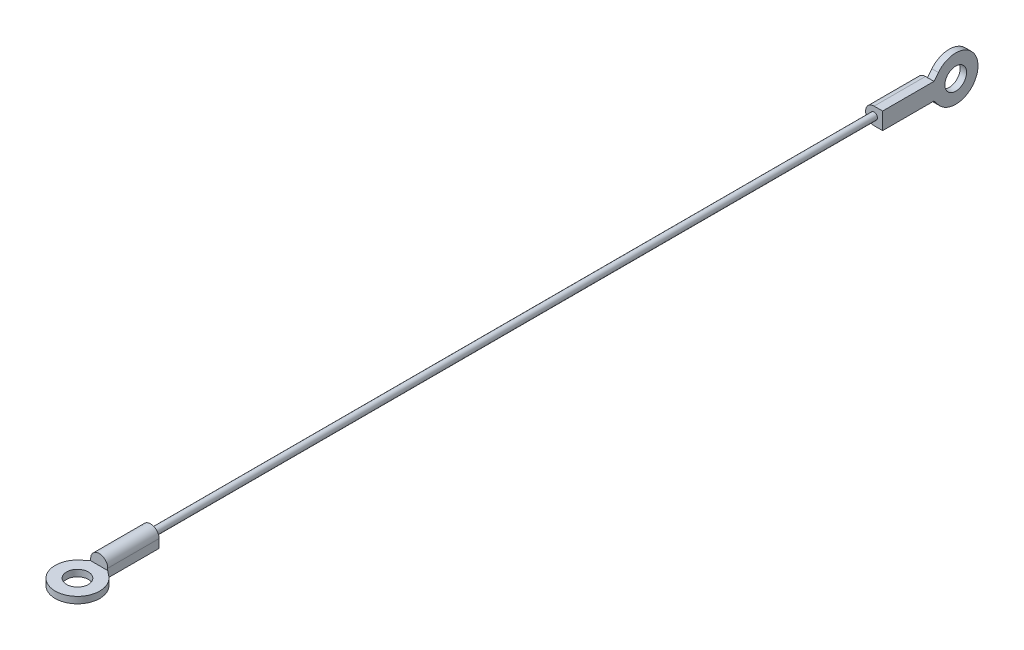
from build123d import *

# Parameters (mm, degrees)
SKETCH1_R           = 0.795
BOSS_EXTRUDE1_DEPTH = 84.52
BOSS_EXTRUDE2_DEPTH = 12
SKETCH3_R           = 2.54
BOSS_EXTRUDE3_DEPTH = 1.52
BOSS_EXTRUDE4_START = 12
BOSS_EXTRUDE4_DEPTH = 12
SKETCH5_R           = 2.54
BOSS_EXTRUDE5_DEPTH = 1.52


with BuildPart() as part:
    # Sketch1 → Boss-Extrude1 (new, symmetric)
    with BuildSketch(Plane.XY):
        Circle(SKETCH1_R)
    extrude(amount=BOSS_EXTRUDE1_DEPTH, both=True)

    # Sketch2 → Boss-Extrude2 (add)
    with BuildSketch(Plane.XY.offset(84.52)):
        with BuildLine():
            Line((-1.99, 0), (-1.99, -1.99))
            Line((-1.99, -1.99), (0, -1.99))
            Line((0, -1.99), (1.99, -1.99))
            Line((1.99, -1.99), (1.99, 0))
            ThreePointArc((1.99, 0), (0, 1.99), (-1.99, 0))
        make_face()
    extrude(amount=BOSS_EXTRUDE2_DEPTH)

    # Sketch3 → Boss-Extrude3 (add)
    with BuildSketch(Plane.XZ.offset(1.99)):
        with BuildLine():
            Line((1.99, 96.52), (3.263901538, 97.545499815))
            ThreePointArc((3.263901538, 97.545499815), (0, 106.805), (-3.263901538, 97.545499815))
            Line((-3.263901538, 97.545499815), (-1.99, 96.52))
            Line((-1.99, 96.52), (1.99, 96.52))
        make_face()
        with Locations(Location((0, 101.6, 0), (0, 0, 270))):
            Circle(SKETCH3_R, mode=Mode.SUBTRACT)
    extrude(amount=-BOSS_EXTRUDE3_DEPTH)

    # Sketch4 → Boss-Extrude4 (add)
    with BuildSketch(Plane(origin=(0, 0, -84.52), x_dir=(-1, 0, 0), z_dir=(0, 0, -1)).offset(BOSS_EXTRUDE4_START)):
        with BuildLine():
            Line((0, 1.99), (-1.99, 1.99))
            Line((-1.99, 1.99), (-1.99, 0))
            Line((-1.99, 0), (-1.99, -1.99))
            Line((-1.99, -1.99), (0, -1.99))
            ThreePointArc((0, -1.99), (1.99, 0), (0, 1.99))
        make_face()
    extrude(amount=-BOSS_EXTRUDE4_DEPTH)

    # Sketch5 → Boss-Extrude5 (add)
    with BuildSketch(Plane(origin=(1.99, 0, 0), x_dir=(0, 0, -1), z_dir=(1, 0, 0))):
        with BuildLine():
            Line((96.52, -1.99), (96.52, 1.99))
            Line((96.52, 1.99), (97.545499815, 3.263901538))
            ThreePointArc((97.545499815, 3.263901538), (106.805, 0), (97.545499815, -3.263901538))
            Line((97.545499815, -3.263901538), (96.52, -1.99))
        make_face()
        with Locations((101.6, 0)):
            Circle(SKETCH5_R, mode=Mode.SUBTRACT)
    extrude(amount=-BOSS_EXTRUDE5_DEPTH)


solid = part.part
